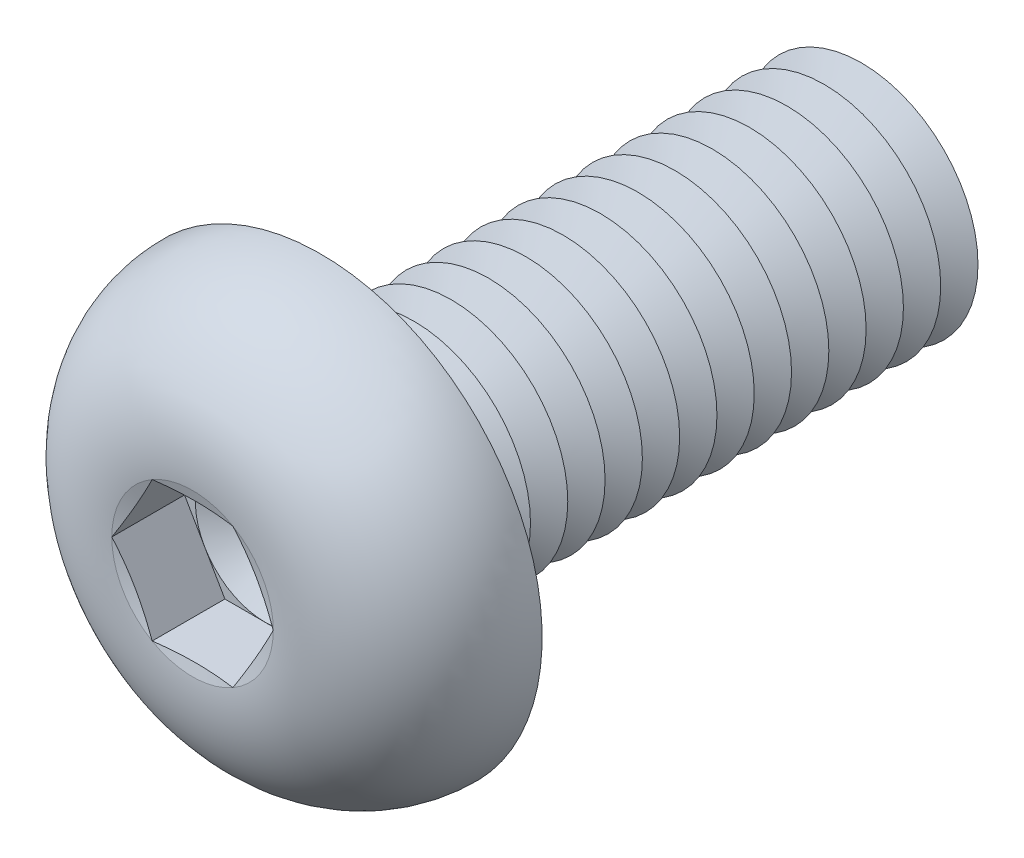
from build123d import *

# Parameters (mm, degrees)
FILLET1_R          = 0.4
LPATTERN1_COUNT    = 15
LPATTERN1_PITCH    = 0.8
CUT_EXTRUDE1_DEPTH = 1.56


with BuildPart() as part:
    # Sketch1 → Revolve1 (revolve)
    with BuildSketch(Plane(origin=(0, 0, 0), x_dir=(0, 0, -1), z_dir=(1, 0, 0)), mode=Mode.PRIVATE) as revolve1_sk:
        with BuildLine():
            Line((0, 2.5), (0, 4.75))
            ThreePointArc((0, 4.75), (-2.041477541, 3.848329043), (-2.75, 1.73205))
            Line((-2.75, 1.73205), (-2.517949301, 0.866025))
            Line((-2.517949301, 0.866025), (-2.75, 0.866025))
            Line((-2.75, 0.866025), (-2.75, 0))
            Line((-2.75, 0), (12, 0))
            Line((12, 0), (12, 2.5))
            Line((12, 2.5), (0, 2.5))
        make_face()
    revolve(revolve1_sk.sketch.rotate(Axis((0, 0, -12), (0, 0, 1)), 90), axis=Axis((0, 0, -12), (0, 0, 1)))

    # Fillet1
    fillet1_edges = [part.edges().sort_by_distance(p)[0] for p in [
        (2.5, 0, 0),
    ]]
    fillet(fillet1_edges, radius=FILLET1_R)

    # Sketch2 → Cut-Revolve1 (revolve, cut)
    with BuildSketch(Plane(origin=(0, 0, 0), x_dir=(0, 0, -1), z_dir=(1, 0, 0)), mode=Mode.PRIVATE) as cut_revolve1_sk:
        Polygon((11.6, 2.5), (12.4, 2.5), (12, 1.807179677), align=None)
    cut_revolve1 = revolve(cut_revolve1_sk.sketch.rotate(Axis((0, 0, -12), (0, 0, -1)), 270), axis=Axis((0, 0, -12), (0, 0, -1)), mode=Mode.SUBTRACT)

    # LPattern1: Cut-Revolve1 ×15
    with Locations(*[(0, 0, i * LPATTERN1_PITCH) for i in range(1, LPATTERN1_COUNT)]):
        add(cut_revolve1, mode=Mode.SUBTRACT)

    # Sketch3 → Cut-Extrude1 (cut)
    with BuildSketch(Plane.XY.offset(2.75)):
        Polygon((0.866025, 1.499999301), (-0.866025, 1.499999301), (-1.73205, 0), (-0.866025, -1.499999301), (0.866025, -1.499999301), (1.73205, 0), align=None)
    extrude(amount=-CUT_EXTRUDE1_DEPTH, mode=Mode.SUBTRACT)

    # Cut-Extrude2 cone 1 section (on through the dimple's axis) → Cut-Extrude2 (revolve, cut)
    with BuildSketch(Plane(origin=(0, 0, 1.19), x_dir=(0, -1, 0), z_dir=(1, 0, 0))):
        Polygon((0, 0), (1.499999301, 0), (0, 0.866025), align=None)
    revolve(axis=Axis((0, 0, 1.19), (0, 0, -1)), mode=Mode.SUBTRACT)


solid = part.part
